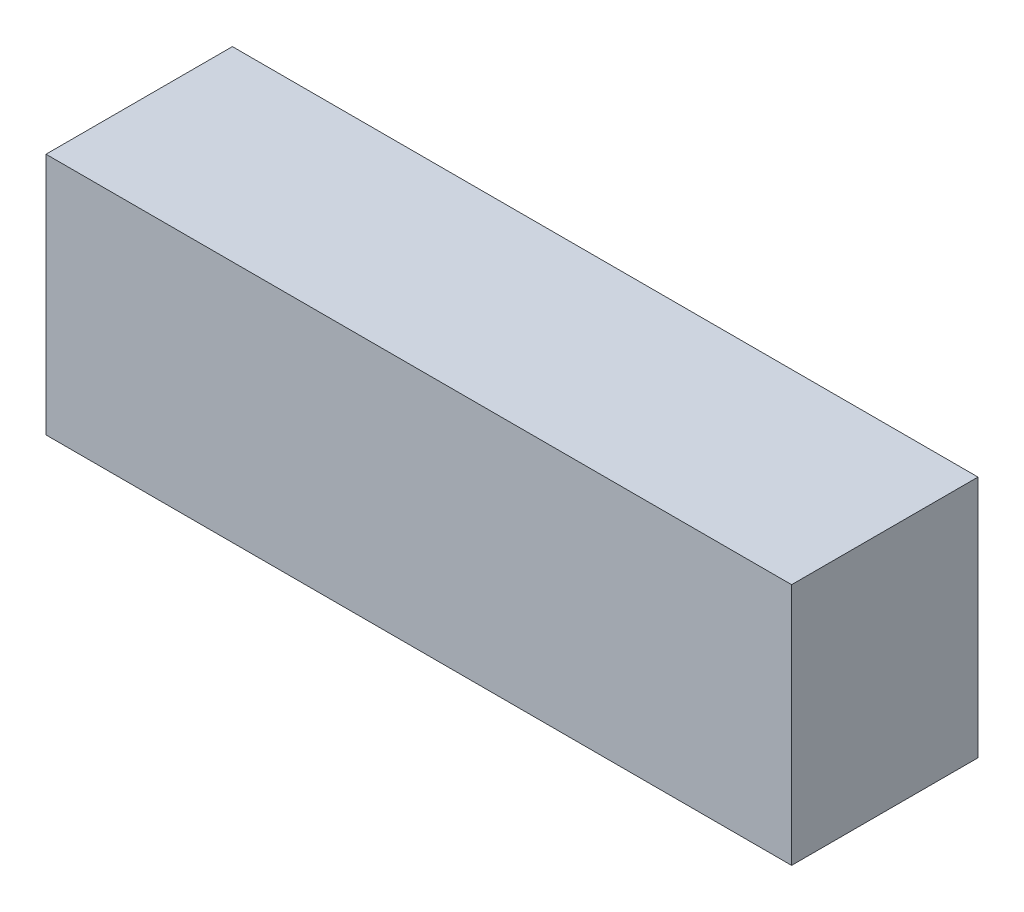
from build123d import *

# Parameters (mm, degrees)
SKETCH1_W           = 230
SKETCH1_H           = 57.5
BOSS_EXTRUDE1_DEPTH = 37.5


with BuildPart() as part:
    # Sketch1 → Boss-Extrude1 (new, symmetric)
    with BuildSketch(Plane(origin=(0, 0, 0), x_dir=(1, 0, 0), z_dir=(0, 1, 0))):
        Rectangle(SKETCH1_W, SKETCH1_H)
    extrude(amount=BOSS_EXTRUDE1_DEPTH, both=True)


solid = part.part
